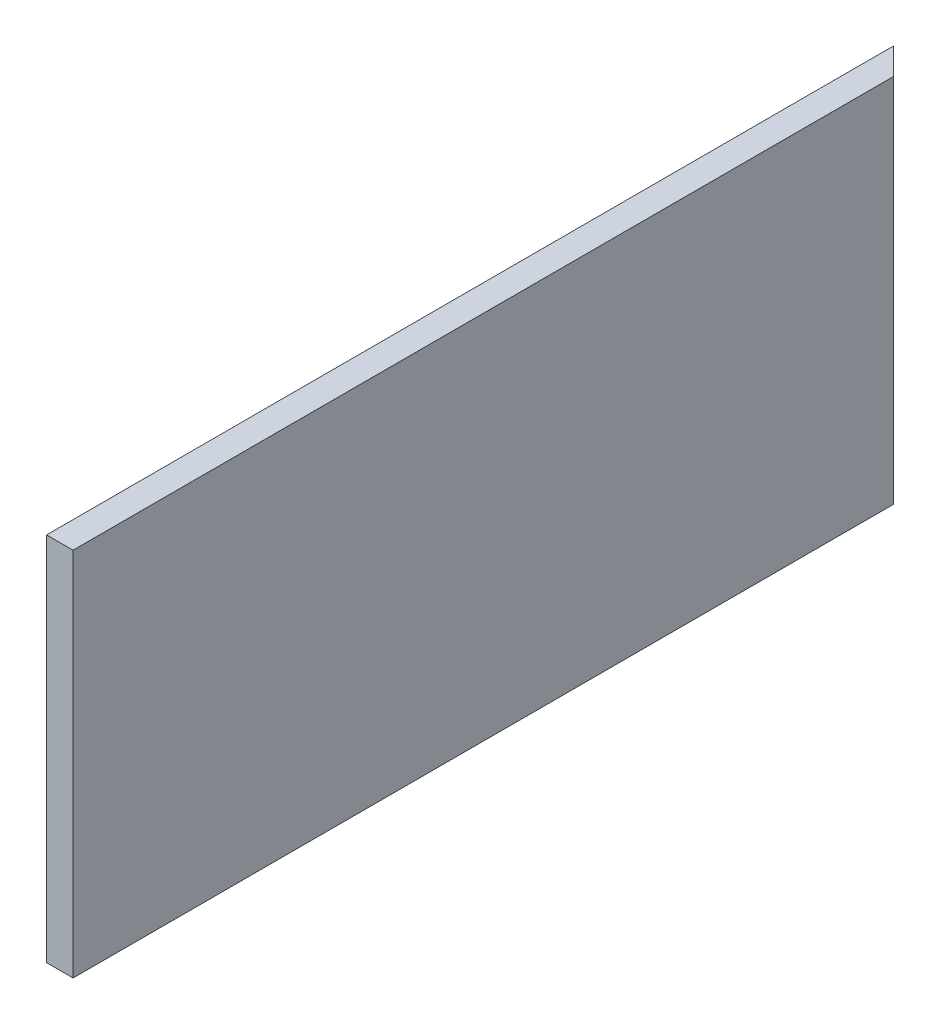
from build123d import *

# Parameters (mm, degrees)
BOSS_EXTRUDE1_DEPTH = 355.6


with BuildPart() as part:
    # Sketch3 → Boss-Extrude1 (new body)
    with BuildSketch(Plane(origin=(0, 0, 0), x_dir=(1, 0, 0), z_dir=(0, 1, 0))):
        Polygon((0, 0), (25.4, 0), (25.4, 787.4), (0, 812.8), align=None)
    extrude(amount=BOSS_EXTRUDE1_DEPTH)


solid = part.part
